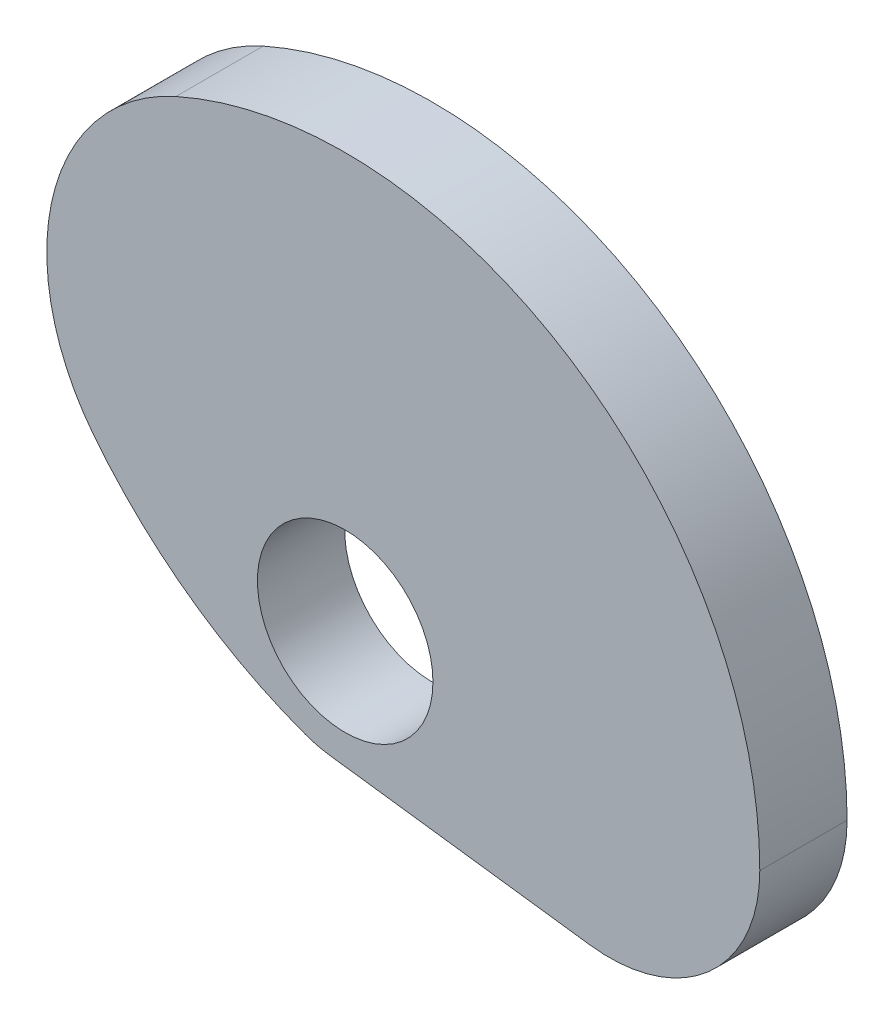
ISO-10303-21;
HEADER;
FILE_DESCRIPTION(('STEP AP214'),'2;1');
FILE_NAME('part.step','',(''),(''),'','','');
FILE_SCHEMA(('AUTOMOTIVE_DESIGN { 1 0 10303 214 1 1 1 1 }'));
ENDSEC;
DATA;
#1=APPLICATION_CONTEXT('core data for automotive mechanical design processes');
#2=APPLICATION_PROTOCOL_DEFINITION('international standard','automotive_design',2000,#1);
#3=PRODUCT_CONTEXT('',#1,'mechanical');
#4=PRODUCT('Part','Part','',(#3));
#5=PRODUCT_RELATED_PRODUCT_CATEGORY('part','',(#4));
#6=PRODUCT_DEFINITION_FORMATION('','',#4);
#7=PRODUCT_DEFINITION_CONTEXT('part definition',#1,'design');
#8=PRODUCT_DEFINITION('design','',#6,#7);
#9=PRODUCT_DEFINITION_SHAPE('','',#8);
#10=(LENGTH_UNIT() NAMED_UNIT(*) SI_UNIT(.MILLI.,.METRE.));
#11=(NAMED_UNIT(*) PLANE_ANGLE_UNIT() SI_UNIT($,.RADIAN.));
#12=(NAMED_UNIT(*) SI_UNIT($,.STERADIAN.) SOLID_ANGLE_UNIT());
#13=UNCERTAINTY_MEASURE_WITH_UNIT(LENGTH_MEASURE(1.E-05),#10,'distance_accuracy_value','');
#14=(GEOMETRIC_REPRESENTATION_CONTEXT(3) GLOBAL_UNCERTAINTY_ASSIGNED_CONTEXT((#13)) GLOBAL_UNIT_ASSIGNED_CONTEXT((#10,
#11,#12)) REPRESENTATION_CONTEXT('',''));
#15=CARTESIAN_POINT('',(0.,0.,0.));
#16=DIRECTION('',(0.,0.,1.));
#17=DIRECTION('',(1.,0.,0.));
#18=AXIS2_PLACEMENT_3D('',#15,#16,#17);
#19=CARTESIAN_POINT('',(60.5,0.,10.));
#20=DIRECTION('',(0.,0.,1.));
#21=DIRECTION('',(1.,0.,0.));
#22=AXIS2_PLACEMENT_3D('',#19,#20,#21);
#23=PLANE('',#22);
#24=CARTESIAN_POINT('',(60.5,0.,10.));
#25=DIRECTION('',(0.,0.,1.));
#26=DIRECTION('',(1.,0.,0.));
#27=AXIS2_PLACEMENT_3D('',#24,#25,#26);
#28=CIRCLE('',#27,34.4984629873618);
#29=CARTESIAN_POINT('',(56.0160762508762,-34.2058237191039,10.));
#30=VERTEX_POINT('',#29);
#31=CARTESIAN_POINT('',(94.9984629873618,0.,10.));
#32=VERTEX_POINT('',#31);
#33=EDGE_CURVE('E120',#30,#32,#28,.T.);
#34=ORIENTED_EDGE('',*,*,#33,.T.);
#35=CARTESIAN_POINT('',(0.,0.,10.));
#36=DIRECTION('',(0.,0.,1.));
#37=DIRECTION('',(1.,0.,0.));
#38=AXIS2_PLACEMENT_3D('',#35,#36,#37);
#39=CIRCLE('',#38,94.9984629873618);
#40=CARTESIAN_POINT('',(-38.7802605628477,86.7225424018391,10.));
#41=VERTEX_POINT('',#40);
#42=EDGE_CURVE('E101',#32,#41,#39,.T.);
#43=ORIENTED_EDGE('',*,*,#42,.T.);
#44=CARTESIAN_POINT('',(-18.37,41.08,10.));
#45=DIRECTION('',(0.,0.,1.));
#46=DIRECTION('',(1.,0.,0.));
#47=AXIS2_PLACEMENT_3D('',#44,#45,#46);
#48=CIRCLE('',#47,49.9982040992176);
#49=CARTESIAN_POINT('',(-57.6542705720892,10.1515909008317,10.));
#50=VERTEX_POINT('',#49);
#51=EDGE_CURVE('E123',#41,#50,#48,.T.);
#52=ORIENTED_EDGE('',*,*,#51,.T.);
#53=CARTESIAN_POINT('',(28.55,78.02,10.));
#54=DIRECTION('',(0.,0.,1.));
#55=DIRECTION('',(1.,0.,0.));
#56=AXIS2_PLACEMENT_3D('',#53,#54,#55);
#57=CIRCLE('',#56,109.714617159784);
#58=CARTESIAN_POINT('',(-9.15301801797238,-25.012905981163,10.));
#59=VERTEX_POINT('',#58);
#60=EDGE_CURVE('E125',#50,#59,#57,.T.);
#61=ORIENTED_EDGE('',*,*,#60,.T.);
#62=CARTESIAN_POINT('',(0.,0.,10.));
#63=DIRECTION('',(0.,0.,1.));
#64=DIRECTION('',(1.,0.,0.));
#65=AXIS2_PLACEMENT_3D('',#62,#63,#64);
#66=CIRCLE('',#65,26.6349996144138);
#67=CARTESIAN_POINT('',(-3.46187333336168,-26.4090639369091,10.));
#68=VERTEX_POINT('',#67);
#69=EDGE_CURVE('E54',#59,#68,#66,.T.);
#70=ORIENTED_EDGE('',*,*,#69,.T.);
#71=DIRECTION('',(0.991517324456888,-0.129974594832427,0.));
#72=VECTOR('',#71,1.);
#73=CARTESIAN_POINT('',(-3.46187333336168,-26.4090639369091,10.));
#74=LINE('',#73,#72);
#75=EDGE_CURVE('E49',#68,#30,#74,.T.);
#76=ORIENTED_EDGE('',*,*,#75,.T.);
#77=EDGE_LOOP('',(#34,#43,#52,#61,#70,#76));
#78=FACE_BOUND('',#77,.T.);
#79=CARTESIAN_POINT('',(0.,0.,10.));
#80=DIRECTION('',(0.,0.,1.));
#81=DIRECTION('',(1.,0.,0.));
#82=AXIS2_PLACEMENT_3D('',#79,#80,#81);
#83=CIRCLE('',#82,20.1104178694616);
#84=CARTESIAN_POINT('',(20.1104178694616,0.,10.));
#85=VERTEX_POINT('',#84);
#86=EDGE_CURVE('E106',#85,#85,#83,.T.);
#87=ORIENTED_EDGE('',*,*,#86,.F.);
#88=EDGE_LOOP('',(#87));
#89=FACE_BOUND('',#88,.T.);
#90=ADVANCED_FACE('F34',(#78,#89),#23,.T.);
#91=CARTESIAN_POINT('',(60.5,0.,-10.));
#92=DIRECTION('',(0.,0.,1.));
#93=DIRECTION('',(1.,0.,0.));
#94=AXIS2_PLACEMENT_3D('',#91,#92,#93);
#95=PLANE('',#94);
#96=CARTESIAN_POINT('',(60.5,0.,-10.));
#97=DIRECTION('',(0.,0.,1.));
#98=DIRECTION('',(1.,0.,0.));
#99=AXIS2_PLACEMENT_3D('',#96,#97,#98);
#100=CIRCLE('',#99,34.4984629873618);
#101=CARTESIAN_POINT('',(56.0160762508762,-34.2058237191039,-10.));
#102=VERTEX_POINT('',#101);
#103=CARTESIAN_POINT('',(94.9984629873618,0.,-10.));
#104=VERTEX_POINT('',#103);
#105=EDGE_CURVE('E92',#102,#104,#100,.T.);
#106=ORIENTED_EDGE('',*,*,#105,.F.);
#107=DIRECTION('',(0.991517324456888,-0.129974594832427,0.));
#108=VECTOR('',#107,1.);
#109=CARTESIAN_POINT('',(-3.46187333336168,-26.4090639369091,-10.));
#110=LINE('',#109,#108);
#111=CARTESIAN_POINT('',(-3.46187333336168,-26.4090639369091,-10.));
#112=VERTEX_POINT('',#111);
#113=EDGE_CURVE('E118',#112,#102,#110,.T.);
#114=ORIENTED_EDGE('',*,*,#113,.F.);
#115=CARTESIAN_POINT('',(0.,0.,-10.));
#116=DIRECTION('',(0.,0.,1.));
#117=DIRECTION('',(1.,0.,0.));
#118=AXIS2_PLACEMENT_3D('',#115,#116,#117);
#119=CIRCLE('',#118,26.6349996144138);
#120=CARTESIAN_POINT('',(-9.15301801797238,-25.012905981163,-10.));
#121=VERTEX_POINT('',#120);
#122=EDGE_CURVE('E116',#121,#112,#119,.T.);
#123=ORIENTED_EDGE('',*,*,#122,.F.);
#124=CARTESIAN_POINT('',(28.55,78.02,-10.));
#125=DIRECTION('',(0.,0.,1.));
#126=DIRECTION('',(1.,0.,0.));
#127=AXIS2_PLACEMENT_3D('',#124,#125,#126);
#128=CIRCLE('',#127,109.714617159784);
#129=CARTESIAN_POINT('',(-57.6542705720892,10.1515909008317,-10.));
#130=VERTEX_POINT('',#129);
#131=EDGE_CURVE('E114',#130,#121,#128,.T.);
#132=ORIENTED_EDGE('',*,*,#131,.F.);
#133=CARTESIAN_POINT('',(-18.37,41.08,-10.));
#134=DIRECTION('',(0.,0.,1.));
#135=DIRECTION('',(1.,0.,0.));
#136=AXIS2_PLACEMENT_3D('',#133,#134,#135);
#137=CIRCLE('',#136,49.9982040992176);
#138=CARTESIAN_POINT('',(-38.7802605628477,86.7225424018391,-10.));
#139=VERTEX_POINT('',#138);
#140=EDGE_CURVE('E94',#139,#130,#137,.T.);
#141=ORIENTED_EDGE('',*,*,#140,.F.);
#142=CARTESIAN_POINT('',(0.,0.,-10.));
#143=DIRECTION('',(0.,0.,1.));
#144=DIRECTION('',(1.,0.,0.));
#145=AXIS2_PLACEMENT_3D('',#142,#143,#144);
#146=CIRCLE('',#145,94.9984629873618);
#147=EDGE_CURVE('E87',#104,#139,#146,.T.);
#148=ORIENTED_EDGE('',*,*,#147,.F.);
#149=EDGE_LOOP('',(#106,#114,#123,#132,#141,#148));
#150=FACE_BOUND('',#149,.T.);
#151=CARTESIAN_POINT('',(0.,0.,-10.));
#152=DIRECTION('',(0.,0.,1.));
#153=DIRECTION('',(1.,0.,0.));
#154=AXIS2_PLACEMENT_3D('',#151,#152,#153);
#155=CIRCLE('',#154,20.1104178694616);
#156=CARTESIAN_POINT('',(20.1104178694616,0.,-10.));
#157=VERTEX_POINT('',#156);
#158=EDGE_CURVE('E109',#157,#157,#155,.T.);
#159=ORIENTED_EDGE('',*,*,#158,.T.);
#160=EDGE_LOOP('',(#159));
#161=FACE_BOUND('',#160,.T.);
#162=ADVANCED_FACE('F88',(#150,#161),#95,.F.);
#163=CARTESIAN_POINT('',(60.5,0.,10.));
#164=DIRECTION('',(0.,0.,-1.));
#165=DIRECTION('',(-1.,0.,0.));
#166=AXIS2_PLACEMENT_3D('',#163,#164,#165);
#167=CYLINDRICAL_SURFACE('',#166,34.4984629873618);
#168=ORIENTED_EDGE('',*,*,#105,.T.);
#169=DIRECTION('',(0.,0.,-1.));
#170=VECTOR('',#169,1.);
#171=CARTESIAN_POINT('',(94.9984629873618,0.,10.));
#172=LINE('',#171,#170);
#173=EDGE_CURVE('E11',#32,#104,#172,.T.);
#174=ORIENTED_EDGE('',*,*,#173,.F.);
#175=ORIENTED_EDGE('',*,*,#33,.F.);
#176=DIRECTION('',(0.,0.,-1.));
#177=VECTOR('',#176,1.);
#178=CARTESIAN_POINT('',(56.0160762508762,-34.2058237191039,10.));
#179=LINE('',#178,#177);
#180=EDGE_CURVE('E105',#30,#102,#179,.T.);
#181=ORIENTED_EDGE('',*,*,#180,.T.);
#182=EDGE_LOOP('',(#168,#174,#175,#181));
#183=FACE_BOUND('',#182,.T.);
#184=ADVANCED_FACE('F36',(#183),#167,.T.);
#185=CARTESIAN_POINT('',(0.,0.,10.));
#186=DIRECTION('',(0.,0.,-1.));
#187=DIRECTION('',(-1.,0.,0.));
#188=AXIS2_PLACEMENT_3D('',#185,#186,#187);
#189=CYLINDRICAL_SURFACE('',#188,94.9984629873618);
#190=ORIENTED_EDGE('',*,*,#147,.T.);
#191=DIRECTION('',(0.,0.,-1.));
#192=VECTOR('',#191,1.);
#193=CARTESIAN_POINT('',(-38.7802605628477,86.7225424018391,10.));
#194=LINE('',#193,#192);
#195=EDGE_CURVE('E42',#41,#139,#194,.T.);
#196=ORIENTED_EDGE('',*,*,#195,.F.);
#197=ORIENTED_EDGE('',*,*,#42,.F.);
#198=ORIENTED_EDGE('',*,*,#173,.T.);
#199=EDGE_LOOP('',(#190,#196,#197,#198));
#200=FACE_BOUND('',#199,.T.);
#201=ADVANCED_FACE('F100',(#200),#189,.T.);
#202=CARTESIAN_POINT('',(-18.37,41.08,10.));
#203=DIRECTION('',(0.,0.,-1.));
#204=DIRECTION('',(-1.,0.,0.));
#205=AXIS2_PLACEMENT_3D('',#202,#203,#204);
#206=CYLINDRICAL_SURFACE('',#205,49.9982040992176);
#207=ORIENTED_EDGE('',*,*,#140,.T.);
#208=DIRECTION('',(0.,0.,-1.));
#209=VECTOR('',#208,1.);
#210=CARTESIAN_POINT('',(-57.6542705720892,10.1515909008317,10.));
#211=LINE('',#210,#209);
#212=EDGE_CURVE('E136',#50,#130,#211,.T.);
#213=ORIENTED_EDGE('',*,*,#212,.F.);
#214=ORIENTED_EDGE('',*,*,#51,.F.);
#215=ORIENTED_EDGE('',*,*,#195,.T.);
#216=EDGE_LOOP('',(#207,#213,#214,#215));
#217=FACE_BOUND('',#216,.T.);
#218=ADVANCED_FACE('F140',(#217),#206,.T.);
#219=CARTESIAN_POINT('',(28.55,78.02,10.));
#220=DIRECTION('',(0.,0.,-1.));
#221=DIRECTION('',(-1.,0.,0.));
#222=AXIS2_PLACEMENT_3D('',#219,#220,#221);
#223=CYLINDRICAL_SURFACE('',#222,109.714617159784);
#224=ORIENTED_EDGE('',*,*,#131,.T.);
#225=DIRECTION('',(0.,0.,-1.));
#226=VECTOR('',#225,1.);
#227=CARTESIAN_POINT('',(-9.15301801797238,-25.012905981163,10.));
#228=LINE('',#227,#226);
#229=EDGE_CURVE('E133',#59,#121,#228,.T.);
#230=ORIENTED_EDGE('',*,*,#229,.F.);
#231=ORIENTED_EDGE('',*,*,#60,.F.);
#232=ORIENTED_EDGE('',*,*,#212,.T.);
#233=EDGE_LOOP('',(#224,#230,#231,#232));
#234=FACE_BOUND('',#233,.T.);
#235=ADVANCED_FACE('F146',(#234),#223,.T.);
#236=CARTESIAN_POINT('',(0.,0.,10.));
#237=DIRECTION('',(0.,0.,-1.));
#238=DIRECTION('',(-1.,0.,0.));
#239=AXIS2_PLACEMENT_3D('',#236,#237,#238);
#240=CYLINDRICAL_SURFACE('',#239,26.6349996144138);
#241=ORIENTED_EDGE('',*,*,#122,.T.);
#242=DIRECTION('',(0.,0.,-1.));
#243=VECTOR('',#242,1.);
#244=CARTESIAN_POINT('',(-3.46187333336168,-26.4090639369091,10.));
#245=LINE('',#244,#243);
#246=EDGE_CURVE('E130',#68,#112,#245,.T.);
#247=ORIENTED_EDGE('',*,*,#246,.F.);
#248=ORIENTED_EDGE('',*,*,#69,.F.);
#249=ORIENTED_EDGE('',*,*,#229,.T.);
#250=EDGE_LOOP('',(#241,#247,#248,#249));
#251=FACE_BOUND('',#250,.T.);
#252=ADVANCED_FACE('F149',(#251),#240,.T.);
#253=CARTESIAN_POINT('',(-3.46187333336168,-26.4090639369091,10.));
#254=DIRECTION('',(0.129974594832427,0.991517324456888,0.));
#255=DIRECTION('',(-0.991517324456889,0.129974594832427,0.));
#256=AXIS2_PLACEMENT_3D('',#253,#254,#255);
#257=PLANE('',#256);
#258=ORIENTED_EDGE('',*,*,#113,.T.);
#259=ORIENTED_EDGE('',*,*,#180,.F.);
#260=ORIENTED_EDGE('',*,*,#75,.F.);
#261=ORIENTED_EDGE('',*,*,#246,.T.);
#262=EDGE_LOOP('',(#258,#259,#260,#261));
#263=FACE_BOUND('',#262,.T.);
#264=ADVANCED_FACE('F151',(#263),#257,.F.);
#265=CARTESIAN_POINT('',(0.,0.,10.));
#266=DIRECTION('',(0.,0.,-1.));
#267=DIRECTION('',(-1.,0.,0.));
#268=AXIS2_PLACEMENT_3D('',#265,#266,#267);
#269=CYLINDRICAL_SURFACE('',#268,20.1104178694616);
#270=ORIENTED_EDGE('',*,*,#86,.T.);
#271=EDGE_LOOP('',(#270));
#272=FACE_BOUND('',#271,.T.);
#273=ORIENTED_EDGE('',*,*,#158,.F.);
#274=EDGE_LOOP('',(#273));
#275=FACE_BOUND('',#274,.T.);
#276=ADVANCED_FACE('F153',(#272,#275),#269,.F.);
#277=CLOSED_SHELL('',(#90,#162,#184,#201,#218,#235,#252,#264,#276));
#278=MANIFOLD_SOLID_BREP('B2',#277);
#279=ADVANCED_BREP_SHAPE_REPRESENTATION('',(#18,#278),#14);
#280=SHAPE_DEFINITION_REPRESENTATION(#9,#279);
ENDSEC;
END-ISO-10303-21;
